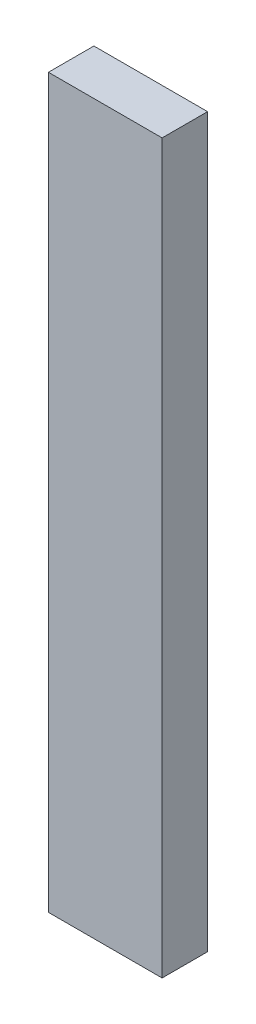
from build123d import *

# Parameters (mm, degrees)
ESQUISSE1_W             = 25
ESQUISSE1_H             = 160
BOSS_EXTRU_1_DEPTH      = 10
ESQUISSE2_R             = 0.75
ENL_V_MAT_EXTRU_1_DEPTH = 10
ESQUISSE3_R             = 0.75
ENL_V_MAT_EXTRU_2_DEPTH = 5


with BuildPart() as part:
    # Esquisse1 → Boss.-Extru.1 (new body)
    with BuildSketch(Plane.XY):
        with Locations((12.5, 80)):
            Rectangle(ESQUISSE1_W, ESQUISSE1_H)
    extrude(amount=BOSS_EXTRU_1_DEPTH)

    # Esquisse2 → Enl_v. mat.-Extru.1 (cut)
    with BuildSketch(Plane.XZ):
        with Locations(Location((12.5, 5, 0), (0, 0, 270))):
            Circle(ESQUISSE2_R)
    extrude(amount=-ENL_V_MAT_EXTRU_1_DEPTH, mode=Mode.SUBTRACT)

    # Esquisse3 → Enl_v. mat.-Extru.2 (cut)
    with BuildSketch(Plane(origin=(0, 0, 0), x_dir=(-1, 0, 0), z_dir=(0, 0, -1))):
        with Locations((-12.5, 150)):
            Circle(ESQUISSE3_R)
        with Locations((-12.5, 128)):
            Circle(ESQUISSE3_R)
        with Locations((-12.5, 106)):
            Circle(ESQUISSE3_R)
        with Locations((-12.5, 45)):
            Circle(ESQUISSE3_R)
    extrude(amount=-ENL_V_MAT_EXTRU_2_DEPTH, mode=Mode.SUBTRACT)


solid = part.part
